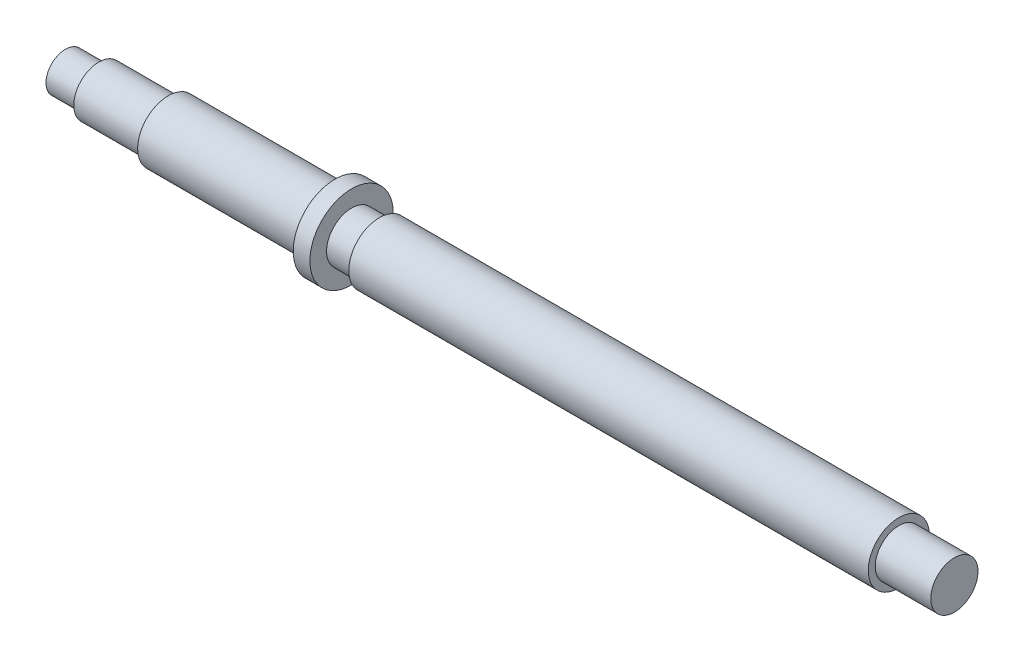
from build123d import *


with BuildPart() as part:
    # Sketch1 → Revolve1 (revolve)
    with BuildSketch(Plane.XY, mode=Mode.PRIVATE) as revolve1_sk:
        Polygon((0, 0), (160, 0), (160, 4.25), (150, 4.25), (150, 5.5), (56.5, 5.5), (56.5, 4.5), (51.5, 4.5), (51.5, 7.5), (48.5, 7.5), (48.5, 5.5), (18.5, 5.5), (18.5, 4.5), (6, 4.5), (6, 3.5), (0, 3.5), align=None)
    revolve(revolve1_sk.sketch.rotate(Axis((160, 0, 0), (1, 0, 0)), 180), axis=Axis((160, 0, 0), (1, 0, 0)))


solid = part.part
